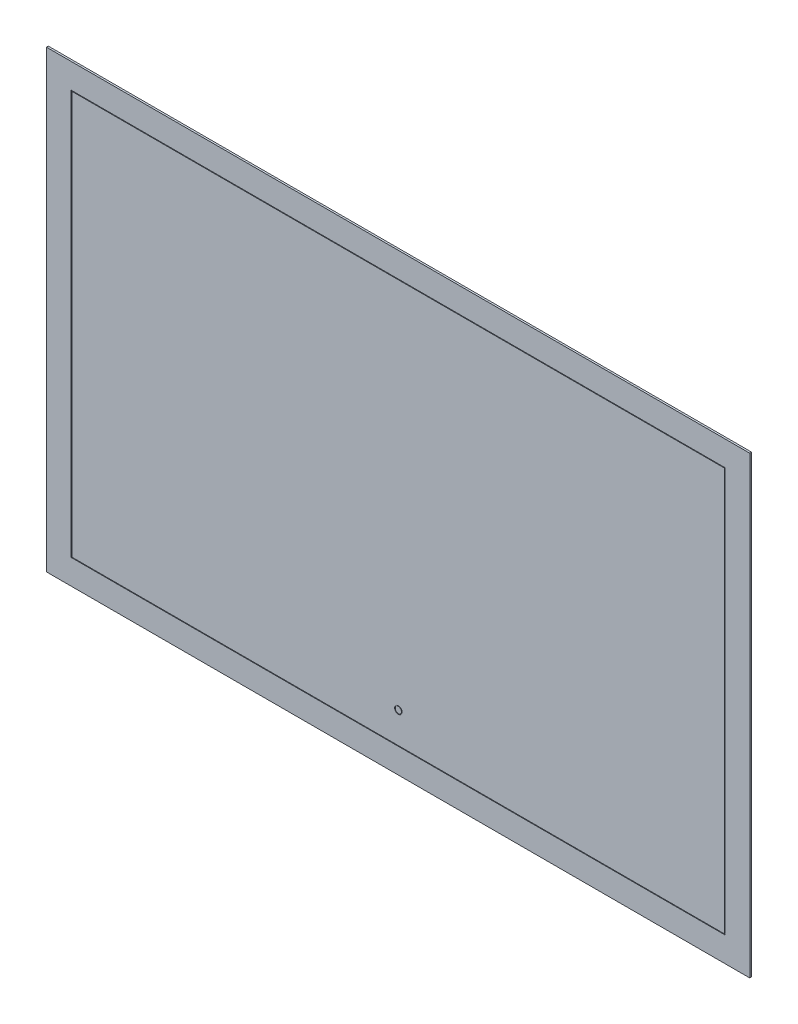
ISO-10303-21;
HEADER;
FILE_DESCRIPTION(('STEP AP214'),'2;1');
FILE_NAME('part.step','',(''),(''),'','','');
FILE_SCHEMA(('AUTOMOTIVE_DESIGN { 1 0 10303 214 1 1 1 1 }'));
ENDSEC;
DATA;
#1=APPLICATION_CONTEXT('core data for automotive mechanical design processes');
#2=APPLICATION_PROTOCOL_DEFINITION('international standard','automotive_design',2000,#1);
#3=PRODUCT_CONTEXT('',#1,'mechanical');
#4=PRODUCT('Part','Part','',(#3));
#5=PRODUCT_RELATED_PRODUCT_CATEGORY('part','',(#4));
#6=PRODUCT_DEFINITION_FORMATION('','',#4);
#7=PRODUCT_DEFINITION_CONTEXT('part definition',#1,'design');
#8=PRODUCT_DEFINITION('design','',#6,#7);
#9=PRODUCT_DEFINITION_SHAPE('','',#8);
#10=(LENGTH_UNIT() NAMED_UNIT(*) SI_UNIT(.MILLI.,.METRE.));
#11=(NAMED_UNIT(*) PLANE_ANGLE_UNIT() SI_UNIT($,.RADIAN.));
#12=(NAMED_UNIT(*) SI_UNIT($,.STERADIAN.) SOLID_ANGLE_UNIT());
#13=UNCERTAINTY_MEASURE_WITH_UNIT(LENGTH_MEASURE(1.E-05),#10,'distance_accuracy_value','');
#14=(GEOMETRIC_REPRESENTATION_CONTEXT(3) GLOBAL_UNCERTAINTY_ASSIGNED_CONTEXT((#13)) GLOBAL_UNIT_ASSIGNED_CONTEXT((#10,
#11,#12)) REPRESENTATION_CONTEXT('',''));
#15=CARTESIAN_POINT('',(0.,0.,0.));
#16=DIRECTION('',(0.,0.,1.));
#17=DIRECTION('',(1.,0.,0.));
#18=AXIS2_PLACEMENT_3D('',#15,#16,#17);
#19=CARTESIAN_POINT('',(0.,0.,0.));
#20=DIRECTION('',(0.,0.,1.));
#21=DIRECTION('',(1.,0.,0.));
#22=AXIS2_PLACEMENT_3D('',#19,#20,#21);
#23=PLANE('',#22);
#24=DIRECTION('',(-1.,0.,0.));
#25=VECTOR('',#24,1.);
#26=CARTESIAN_POINT('',(0.,0.,0.));
#27=LINE('',#26,#25);
#28=CARTESIAN_POINT('',(1130.,0.,0.));
#29=VERTEX_POINT('',#28);
#30=CARTESIAN_POINT('',(0.,0.,0.));
#31=VERTEX_POINT('',#30);
#32=EDGE_CURVE('E356',#29,#31,#27,.T.);
#33=ORIENTED_EDGE('',*,*,#32,.T.);
#34=DIRECTION('',(0.,1.,0.));
#35=VECTOR('',#34,1.);
#36=CARTESIAN_POINT('',(0.,0.,0.));
#37=LINE('',#36,#35);
#38=CARTESIAN_POINT('',(0.,730.,0.));
#39=VERTEX_POINT('',#38);
#40=EDGE_CURVE('E371',#31,#39,#37,.T.);
#41=ORIENTED_EDGE('',*,*,#40,.T.);
#42=DIRECTION('',(1.,0.,0.));
#43=VECTOR('',#42,1.);
#44=CARTESIAN_POINT('',(0.,730.,0.));
#45=LINE('',#44,#43);
#46=CARTESIAN_POINT('',(1130.,730.,0.));
#47=VERTEX_POINT('',#46);
#48=EDGE_CURVE('E391',#39,#47,#45,.T.);
#49=ORIENTED_EDGE('',*,*,#48,.T.);
#50=DIRECTION('',(0.,-1.,0.));
#51=VECTOR('',#50,1.);
#52=CARTESIAN_POINT('',(1130.,3.43712881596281E-13,0.));
#53=LINE('',#52,#51);
#54=EDGE_CURVE('E387',#47,#29,#53,.T.);
#55=ORIENTED_EDGE('',*,*,#54,.T.);
#56=EDGE_LOOP('',(#33,#41,#49,#55));
#57=FACE_BOUND('',#56,.T.);
#58=DIRECTION('',(0.,-1.,0.));
#59=VECTOR('',#58,1.);
#60=CARTESIAN_POINT('',(1095.,695.,0.));
#61=LINE('',#60,#59);
#62=CARTESIAN_POINT('',(1095.,695.,0.));
#63=VERTEX_POINT('',#62);
#64=CARTESIAN_POINT('',(1095.,35.,0.));
#65=VERTEX_POINT('',#64);
#66=EDGE_CURVE('E67',#63,#65,#61,.T.);
#67=ORIENTED_EDGE('',*,*,#66,.F.);
#68=DIRECTION('',(1.,0.,0.));
#69=VECTOR('',#68,1.);
#70=CARTESIAN_POINT('',(35.,695.,0.));
#71=LINE('',#70,#69);
#72=CARTESIAN_POINT('',(35.,695.,0.));
#73=VERTEX_POINT('',#72);
#74=EDGE_CURVE('E239',#73,#63,#71,.T.);
#75=ORIENTED_EDGE('',*,*,#74,.F.);
#76=DIRECTION('',(0.,1.,0.));
#77=VECTOR('',#76,1.);
#78=CARTESIAN_POINT('',(35.,35.,0.));
#79=LINE('',#78,#77);
#80=CARTESIAN_POINT('',(35.,35.,0.));
#81=VERTEX_POINT('',#80);
#82=EDGE_CURVE('E255',#81,#73,#79,.T.);
#83=ORIENTED_EDGE('',*,*,#82,.F.);
#84=DIRECTION('',(-1.,0.,0.));
#85=VECTOR('',#84,1.);
#86=CARTESIAN_POINT('',(1095.,35.,0.));
#87=LINE('',#86,#85);
#88=EDGE_CURVE('E251',#65,#81,#87,.T.);
#89=ORIENTED_EDGE('',*,*,#88,.F.);
#90=EDGE_LOOP('',(#67,#75,#83,#89));
#91=FACE_BOUND('',#90,.T.);
#92=ADVANCED_FACE('F43',(#57,#91),#23,.F.);
#93=CARTESIAN_POINT('',(0.,0.,3.));
#94=DIRECTION('',(0.,-1.,0.));
#95=DIRECTION('',(1.,0.,0.));
#96=AXIS2_PLACEMENT_3D('',#93,#94,#95);
#97=PLANE('',#96);
#98=ORIENTED_EDGE('',*,*,#32,.F.);
#99=DIRECTION('',(0.,0.,-1.));
#100=VECTOR('',#99,1.);
#101=CARTESIAN_POINT('',(1130.,0.,3.));
#102=LINE('',#101,#100);
#103=CARTESIAN_POINT('',(1130.,0.,3.));
#104=VERTEX_POINT('',#103);
#105=EDGE_CURVE('E11',#104,#29,#102,.T.);
#106=ORIENTED_EDGE('',*,*,#105,.F.);
#107=DIRECTION('',(-1.,0.,0.));
#108=VECTOR('',#107,1.);
#109=CARTESIAN_POINT('',(0.,0.,3.));
#110=LINE('',#109,#108);
#111=CARTESIAN_POINT('',(0.,0.,3.));
#112=VERTEX_POINT('',#111);
#113=EDGE_CURVE('E366',#104,#112,#110,.T.);
#114=ORIENTED_EDGE('',*,*,#113,.T.);
#115=DIRECTION('',(0.,0.,-1.));
#116=VECTOR('',#115,1.);
#117=CARTESIAN_POINT('',(0.,0.,3.));
#118=LINE('',#117,#116);
#119=EDGE_CURVE('E383',#112,#31,#118,.T.);
#120=ORIENTED_EDGE('',*,*,#119,.T.);
#121=EDGE_LOOP('',(#98,#106,#114,#120));
#122=FACE_BOUND('',#121,.T.);
#123=ADVANCED_FACE('F45',(#122),#97,.T.);
#124=CARTESIAN_POINT('',(1130.,3.43712881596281E-13,3.));
#125=DIRECTION('',(1.,0.,0.));
#126=DIRECTION('',(0.,1.,0.));
#127=AXIS2_PLACEMENT_3D('',#124,#125,#126);
#128=PLANE('',#127);
#129=ORIENTED_EDGE('',*,*,#54,.F.);
#130=DIRECTION('',(0.,0.,-1.));
#131=VECTOR('',#130,1.);
#132=CARTESIAN_POINT('',(1130.,730.,3.));
#133=LINE('',#132,#131);
#134=CARTESIAN_POINT('',(1130.,730.,3.));
#135=VERTEX_POINT('',#134);
#136=EDGE_CURVE('E52',#135,#47,#133,.T.);
#137=ORIENTED_EDGE('',*,*,#136,.F.);
#138=DIRECTION('',(0.,-1.,0.));
#139=VECTOR('',#138,1.);
#140=CARTESIAN_POINT('',(1130.,3.43712881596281E-13,3.));
#141=LINE('',#140,#139);
#142=EDGE_CURVE('E370',#135,#104,#141,.T.);
#143=ORIENTED_EDGE('',*,*,#142,.T.);
#144=ORIENTED_EDGE('',*,*,#105,.T.);
#145=EDGE_LOOP('',(#129,#137,#143,#144));
#146=FACE_BOUND('',#145,.T.);
#147=ADVANCED_FACE('F410',(#146),#128,.T.);
#148=CARTESIAN_POINT('',(0.,730.,3.));
#149=DIRECTION('',(0.,1.,0.));
#150=DIRECTION('',(0.,0.,1.));
#151=AXIS2_PLACEMENT_3D('',#148,#149,#150);
#152=PLANE('',#151);
#153=ORIENTED_EDGE('',*,*,#48,.F.);
#154=DIRECTION('',(0.,0.,-1.));
#155=VECTOR('',#154,1.);
#156=CARTESIAN_POINT('',(0.,730.,3.));
#157=LINE('',#156,#155);
#158=CARTESIAN_POINT('',(0.,730.,3.));
#159=VERTEX_POINT('',#158);
#160=EDGE_CURVE('E400',#159,#39,#157,.T.);
#161=ORIENTED_EDGE('',*,*,#160,.F.);
#162=DIRECTION('',(1.,0.,0.));
#163=VECTOR('',#162,1.);
#164=CARTESIAN_POINT('',(0.,730.,3.));
#165=LINE('',#164,#163);
#166=EDGE_CURVE('E375',#159,#135,#165,.T.);
#167=ORIENTED_EDGE('',*,*,#166,.T.);
#168=ORIENTED_EDGE('',*,*,#136,.T.);
#169=EDGE_LOOP('',(#153,#161,#167,#168));
#170=FACE_BOUND('',#169,.T.);
#171=ADVANCED_FACE('F406',(#170),#152,.T.);
#172=CARTESIAN_POINT('',(0.,0.,3.));
#173=DIRECTION('',(-1.,0.,0.));
#174=DIRECTION('',(0.,0.,1.));
#175=AXIS2_PLACEMENT_3D('',#172,#173,#174);
#176=PLANE('',#175);
#177=ORIENTED_EDGE('',*,*,#40,.F.);
#178=ORIENTED_EDGE('',*,*,#119,.F.);
#179=DIRECTION('',(0.,1.,0.));
#180=VECTOR('',#179,1.);
#181=CARTESIAN_POINT('',(0.,0.,3.));
#182=LINE('',#181,#180);
#183=EDGE_CURVE('E379',#112,#159,#182,.T.);
#184=ORIENTED_EDGE('',*,*,#183,.T.);
#185=ORIENTED_EDGE('',*,*,#160,.T.);
#186=EDGE_LOOP('',(#177,#178,#184,#185));
#187=FACE_BOUND('',#186,.T.);
#188=ADVANCED_FACE('F415',(#187),#176,.T.);
#189=CARTESIAN_POINT('',(0.,0.,3.));
#190=DIRECTION('',(0.,0.,1.));
#191=DIRECTION('',(1.,0.,0.));
#192=AXIS2_PLACEMENT_3D('',#189,#190,#191);
#193=PLANE('',#192);
#194=DIRECTION('',(0.,-1.,0.));
#195=VECTOR('',#194,1.);
#196=CARTESIAN_POINT('',(40.,690.,3.));
#197=LINE('',#196,#195);
#198=CARTESIAN_POINT('',(40.,690.,3.));
#199=VERTEX_POINT('',#198);
#200=CARTESIAN_POINT('',(40.,40.,3.));
#201=VERTEX_POINT('',#200);
#202=EDGE_CURVE('E312',#199,#201,#197,.T.);
#203=ORIENTED_EDGE('',*,*,#202,.F.);
#204=DIRECTION('',(-1.,0.,0.));
#205=VECTOR('',#204,1.);
#206=CARTESIAN_POINT('',(1090.,690.,3.));
#207=LINE('',#206,#205);
#208=CARTESIAN_POINT('',(1090.,690.,3.));
#209=VERTEX_POINT('',#208);
#210=EDGE_CURVE('E327',#209,#199,#207,.T.);
#211=ORIENTED_EDGE('',*,*,#210,.F.);
#212=DIRECTION('',(0.,1.,0.));
#213=VECTOR('',#212,1.);
#214=CARTESIAN_POINT('',(1090.,40.,3.));
#215=LINE('',#214,#213);
#216=CARTESIAN_POINT('',(1090.,40.,3.));
#217=VERTEX_POINT('',#216);
#218=EDGE_CURVE('E346',#217,#209,#215,.T.);
#219=ORIENTED_EDGE('',*,*,#218,.F.);
#220=DIRECTION('',(1.,0.,0.));
#221=VECTOR('',#220,1.);
#222=CARTESIAN_POINT('',(40.,40.,3.));
#223=LINE('',#222,#221);
#224=EDGE_CURVE('E342',#201,#217,#223,.T.);
#225=ORIENTED_EDGE('',*,*,#224,.F.);
#226=EDGE_LOOP('',(#203,#211,#219,#225));
#227=FACE_BOUND('',#226,.T.);
#228=ORIENTED_EDGE('',*,*,#113,.F.);
#229=ORIENTED_EDGE('',*,*,#142,.F.);
#230=ORIENTED_EDGE('',*,*,#166,.F.);
#231=ORIENTED_EDGE('',*,*,#183,.F.);
#232=EDGE_LOOP('',(#228,#229,#230,#231));
#233=FACE_BOUND('',#232,.T.);
#234=ADVANCED_FACE('F419',(#227,#233),#193,.T.);
#235=CARTESIAN_POINT('',(40.,690.,2.));
#236=DIRECTION('',(-1.,0.,0.));
#237=DIRECTION('',(0.,0.,1.));
#238=AXIS2_PLACEMENT_3D('',#235,#236,#237);
#239=PLANE('',#238);
#240=ORIENTED_EDGE('',*,*,#202,.T.);
#241=DIRECTION('',(0.,0.,1.));
#242=VECTOR('',#241,1.);
#243=CARTESIAN_POINT('',(40.,40.,2.));
#244=LINE('',#243,#242);
#245=CARTESIAN_POINT('',(40.,40.,2.));
#246=VERTEX_POINT('',#245);
#247=EDGE_CURVE('E339',#246,#201,#244,.T.);
#248=ORIENTED_EDGE('',*,*,#247,.F.);
#249=DIRECTION('',(0.,-1.,0.));
#250=VECTOR('',#249,1.);
#251=CARTESIAN_POINT('',(40.,690.,2.));
#252=LINE('',#251,#250);
#253=CARTESIAN_POINT('',(40.,690.,2.));
#254=VERTEX_POINT('',#253);
#255=EDGE_CURVE('E322',#254,#246,#252,.T.);
#256=ORIENTED_EDGE('',*,*,#255,.F.);
#257=DIRECTION('',(0.,0.,1.));
#258=VECTOR('',#257,1.);
#259=CARTESIAN_POINT('',(40.,690.,2.));
#260=LINE('',#259,#258);
#261=EDGE_CURVE('E353',#254,#199,#260,.T.);
#262=ORIENTED_EDGE('',*,*,#261,.T.);
#263=EDGE_LOOP('',(#240,#248,#256,#262));
#264=FACE_BOUND('',#263,.T.);
#265=ADVANCED_FACE('F450',(#264),#239,.F.);
#266=CARTESIAN_POINT('',(1090.,690.,2.));
#267=DIRECTION('',(0.,1.,0.));
#268=DIRECTION('',(0.,0.,1.));
#269=AXIS2_PLACEMENT_3D('',#266,#267,#268);
#270=PLANE('',#269);
#271=ORIENTED_EDGE('',*,*,#210,.T.);
#272=ORIENTED_EDGE('',*,*,#261,.F.);
#273=DIRECTION('',(-1.,0.,0.));
#274=VECTOR('',#273,1.);
#275=CARTESIAN_POINT('',(1090.,690.,2.));
#276=LINE('',#275,#274);
#277=CARTESIAN_POINT('',(1090.,690.,2.));
#278=VERTEX_POINT('',#277);
#279=EDGE_CURVE('E335',#278,#254,#276,.T.);
#280=ORIENTED_EDGE('',*,*,#279,.F.);
#281=DIRECTION('',(0.,0.,1.));
#282=VECTOR('',#281,1.);
#283=CARTESIAN_POINT('',(1090.,690.,2.));
#284=LINE('',#283,#282);
#285=EDGE_CURVE('E357',#278,#209,#284,.T.);
#286=ORIENTED_EDGE('',*,*,#285,.T.);
#287=EDGE_LOOP('',(#271,#272,#280,#286));
#288=FACE_BOUND('',#287,.T.);
#289=ADVANCED_FACE('F459',(#288),#270,.F.);
#290=CARTESIAN_POINT('',(1090.,40.,2.));
#291=DIRECTION('',(1.,0.,0.));
#292=DIRECTION('',(0.,1.,0.));
#293=AXIS2_PLACEMENT_3D('',#290,#291,#292);
#294=PLANE('',#293);
#295=ORIENTED_EDGE('',*,*,#218,.T.);
#296=ORIENTED_EDGE('',*,*,#285,.F.);
#297=DIRECTION('',(0.,1.,0.));
#298=VECTOR('',#297,1.);
#299=CARTESIAN_POINT('',(1090.,40.,2.));
#300=LINE('',#299,#298);
#301=CARTESIAN_POINT('',(1090.,40.,2.));
#302=VERTEX_POINT('',#301);
#303=EDGE_CURVE('E331',#302,#278,#300,.T.);
#304=ORIENTED_EDGE('',*,*,#303,.F.);
#305=DIRECTION('',(0.,0.,1.));
#306=VECTOR('',#305,1.);
#307=CARTESIAN_POINT('',(1090.,40.,2.));
#308=LINE('',#307,#306);
#309=EDGE_CURVE('E360',#302,#217,#308,.T.);
#310=ORIENTED_EDGE('',*,*,#309,.T.);
#311=EDGE_LOOP('',(#295,#296,#304,#310));
#312=FACE_BOUND('',#311,.T.);
#313=ADVANCED_FACE('F466',(#312),#294,.F.);
#314=CARTESIAN_POINT('',(40.,40.,2.));
#315=DIRECTION('',(0.,-1.,0.));
#316=DIRECTION('',(1.,0.,0.));
#317=AXIS2_PLACEMENT_3D('',#314,#315,#316);
#318=PLANE('',#317);
#319=ORIENTED_EDGE('',*,*,#224,.T.);
#320=ORIENTED_EDGE('',*,*,#309,.F.);
#321=DIRECTION('',(1.,0.,0.));
#322=VECTOR('',#321,1.);
#323=CARTESIAN_POINT('',(40.,40.,2.));
#324=LINE('',#323,#322);
#325=EDGE_CURVE('E326',#246,#302,#324,.T.);
#326=ORIENTED_EDGE('',*,*,#325,.F.);
#327=ORIENTED_EDGE('',*,*,#247,.T.);
#328=EDGE_LOOP('',(#319,#320,#326,#327));
#329=FACE_BOUND('',#328,.T.);
#330=ADVANCED_FACE('F474',(#329),#318,.F.);
#331=CARTESIAN_POINT('',(0.,0.,2.));
#332=DIRECTION('',(0.,0.,1.));
#333=DIRECTION('',(1.,0.,0.));
#334=AXIS2_PLACEMENT_3D('',#331,#332,#333);
#335=PLANE('',#334);
#336=DIRECTION('',(0.,1.,0.));
#337=VECTOR('',#336,1.);
#338=CARTESIAN_POINT('',(1089.,41.0000000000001,2.));
#339=LINE('',#338,#337);
#340=CARTESIAN_POINT('',(1089.,41.0000000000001,2.));
#341=VERTEX_POINT('',#340);
#342=CARTESIAN_POINT('',(1089.,689.,2.));
#343=VERTEX_POINT('',#342);
#344=EDGE_CURVE('E290',#341,#343,#339,.T.);
#345=ORIENTED_EDGE('',*,*,#344,.F.);
#346=DIRECTION('',(1.,0.,0.));
#347=VECTOR('',#346,1.);
#348=CARTESIAN_POINT('',(41.,41.,2.));
#349=LINE('',#348,#347);
#350=CARTESIAN_POINT('',(41.,41.,2.));
#351=VERTEX_POINT('',#350);
#352=EDGE_CURVE('E286',#351,#341,#349,.T.);
#353=ORIENTED_EDGE('',*,*,#352,.F.);
#354=DIRECTION('',(0.,-1.,0.));
#355=VECTOR('',#354,1.);
#356=CARTESIAN_POINT('',(41.,689.,2.));
#357=LINE('',#356,#355);
#358=CARTESIAN_POINT('',(41.,689.,2.));
#359=VERTEX_POINT('',#358);
#360=EDGE_CURVE('E281',#359,#351,#357,.T.);
#361=ORIENTED_EDGE('',*,*,#360,.F.);
#362=DIRECTION('',(-1.,0.,0.));
#363=VECTOR('',#362,1.);
#364=CARTESIAN_POINT('',(1089.,689.,2.));
#365=LINE('',#364,#363);
#366=EDGE_CURVE('E277',#343,#359,#365,.T.);
#367=ORIENTED_EDGE('',*,*,#366,.F.);
#368=EDGE_LOOP('',(#345,#353,#361,#367));
#369=FACE_BOUND('',#368,.T.);
#370=ORIENTED_EDGE('',*,*,#255,.T.);
#371=ORIENTED_EDGE('',*,*,#325,.T.);
#372=ORIENTED_EDGE('',*,*,#303,.T.);
#373=ORIENTED_EDGE('',*,*,#279,.T.);
#374=EDGE_LOOP('',(#370,#371,#372,#373));
#375=FACE_BOUND('',#374,.T.);
#376=ADVANCED_FACE('F482',(#369,#375),#335,.T.);
#377=CARTESIAN_POINT('',(1089.,689.,2.));
#378=DIRECTION('',(0.,1.,0.));
#379=DIRECTION('',(-1.,0.,0.));
#380=AXIS2_PLACEMENT_3D('',#377,#378,#379);
#381=PLANE('',#380);
#382=DIRECTION('',(-1.,0.,0.));
#383=VECTOR('',#382,1.);
#384=CARTESIAN_POINT('',(1089.,689.,3.));
#385=LINE('',#384,#383);
#386=CARTESIAN_POINT('',(1089.,689.,3.));
#387=VERTEX_POINT('',#386);
#388=CARTESIAN_POINT('',(41.,689.,3.));
#389=VERTEX_POINT('',#388);
#390=EDGE_CURVE('E276',#387,#389,#385,.T.);
#391=ORIENTED_EDGE('',*,*,#390,.F.);
#392=DIRECTION('',(0.,0.,1.));
#393=VECTOR('',#392,1.);
#394=CARTESIAN_POINT('',(1089.,689.,2.));
#395=LINE('',#394,#393);
#396=EDGE_CURVE('E309',#343,#387,#395,.T.);
#397=ORIENTED_EDGE('',*,*,#396,.F.);
#398=ORIENTED_EDGE('',*,*,#366,.T.);
#399=DIRECTION('',(0.,0.,1.));
#400=VECTOR('',#399,1.);
#401=CARTESIAN_POINT('',(41.,689.,2.));
#402=LINE('',#401,#400);
#403=EDGE_CURVE('E294',#359,#389,#402,.T.);
#404=ORIENTED_EDGE('',*,*,#403,.T.);
#405=EDGE_LOOP('',(#391,#397,#398,#404));
#406=FACE_BOUND('',#405,.T.);
#407=ADVANCED_FACE('F490',(#406),#381,.T.);
#408=CARTESIAN_POINT('',(1089.,41.0000000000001,2.));
#409=DIRECTION('',(1.,0.,0.));
#410=DIRECTION('',(0.,0.,-1.));
#411=AXIS2_PLACEMENT_3D('',#408,#409,#410);
#412=PLANE('',#411);
#413=DIRECTION('',(0.,1.,0.));
#414=VECTOR('',#413,1.);
#415=CARTESIAN_POINT('',(1089.,41.0000000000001,3.));
#416=LINE('',#415,#414);
#417=CARTESIAN_POINT('',(1089.,41.0000000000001,3.));
#418=VERTEX_POINT('',#417);
#419=EDGE_CURVE('E282',#418,#387,#416,.T.);
#420=ORIENTED_EDGE('',*,*,#419,.F.);
#421=DIRECTION('',(0.,0.,1.));
#422=VECTOR('',#421,1.);
#423=CARTESIAN_POINT('',(1089.,41.0000000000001,2.));
#424=LINE('',#423,#422);
#425=EDGE_CURVE('E313',#341,#418,#424,.T.);
#426=ORIENTED_EDGE('',*,*,#425,.F.);
#427=ORIENTED_EDGE('',*,*,#344,.T.);
#428=ORIENTED_EDGE('',*,*,#396,.T.);
#429=EDGE_LOOP('',(#420,#426,#427,#428));
#430=FACE_BOUND('',#429,.T.);
#431=ADVANCED_FACE('F498',(#430),#412,.T.);
#432=CARTESIAN_POINT('',(41.,41.,2.));
#433=DIRECTION('',(0.,-1.,0.));
#434=DIRECTION('',(1.,0.,0.));
#435=AXIS2_PLACEMENT_3D('',#432,#433,#434);
#436=PLANE('',#435);
#437=DIRECTION('',(1.,0.,0.));
#438=VECTOR('',#437,1.);
#439=CARTESIAN_POINT('',(41.,41.,3.));
#440=LINE('',#439,#438);
#441=CARTESIAN_POINT('',(41.,41.,3.));
#442=VERTEX_POINT('',#441);
#443=EDGE_CURVE('E302',#442,#418,#440,.T.);
#444=ORIENTED_EDGE('',*,*,#443,.F.);
#445=DIRECTION('',(0.,0.,1.));
#446=VECTOR('',#445,1.);
#447=CARTESIAN_POINT('',(41.,41.,2.));
#448=LINE('',#447,#446);
#449=EDGE_CURVE('E316',#351,#442,#448,.T.);
#450=ORIENTED_EDGE('',*,*,#449,.F.);
#451=ORIENTED_EDGE('',*,*,#352,.T.);
#452=ORIENTED_EDGE('',*,*,#425,.T.);
#453=EDGE_LOOP('',(#444,#450,#451,#452));
#454=FACE_BOUND('',#453,.T.);
#455=ADVANCED_FACE('F506',(#454),#436,.T.);
#456=CARTESIAN_POINT('',(41.,689.,2.));
#457=DIRECTION('',(-1.,0.,0.));
#458=DIRECTION('',(0.,0.,1.));
#459=AXIS2_PLACEMENT_3D('',#456,#457,#458);
#460=PLANE('',#459);
#461=DIRECTION('',(0.,-1.,0.));
#462=VECTOR('',#461,1.);
#463=CARTESIAN_POINT('',(41.,689.,3.));
#464=LINE('',#463,#462);
#465=EDGE_CURVE('E298',#389,#442,#464,.T.);
#466=ORIENTED_EDGE('',*,*,#465,.F.);
#467=ORIENTED_EDGE('',*,*,#403,.F.);
#468=ORIENTED_EDGE('',*,*,#360,.T.);
#469=ORIENTED_EDGE('',*,*,#449,.T.);
#470=EDGE_LOOP('',(#466,#467,#468,#469));
#471=FACE_BOUND('',#470,.T.);
#472=ADVANCED_FACE('F514',(#471),#460,.T.);
#473=CARTESIAN_POINT('',(565.5,90.4999999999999,3.));
#474=DIRECTION('',(0.,0.,1.));
#475=DIRECTION('',(1.,0.,0.));
#476=AXIS2_PLACEMENT_3D('',#473,#474,#475);
#477=CIRCLE('',#476,5.99999999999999);
#478=CARTESIAN_POINT('',(571.5,90.4999999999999,3.));
#479=VERTEX_POINT('',#478);
#480=EDGE_CURVE('E210',#479,#479,#477,.T.);
#481=ORIENTED_EDGE('',*,*,#480,.F.);
#482=EDGE_LOOP('',(#481));
#483=FACE_BOUND('',#482,.T.);
#484=ORIENTED_EDGE('',*,*,#419,.T.);
#485=ORIENTED_EDGE('',*,*,#390,.T.);
#486=ORIENTED_EDGE('',*,*,#465,.T.);
#487=ORIENTED_EDGE('',*,*,#443,.T.);
#488=EDGE_LOOP('',(#484,#485,#486,#487));
#489=FACE_BOUND('',#488,.T.);
#490=ADVANCED_FACE('F453',(#483,#489),#193,.T.);
#491=CARTESIAN_POINT('',(1095.,695.,-30.));
#492=DIRECTION('',(-1.,0.,0.));
#493=DIRECTION('',(0.,-1.,0.));
#494=AXIS2_PLACEMENT_3D('',#491,#492,#493);
#495=PLANE('',#494);
#496=ORIENTED_EDGE('',*,*,#66,.T.);
#497=DIRECTION('',(0.,0.,1.));
#498=VECTOR('',#497,1.);
#499=CARTESIAN_POINT('',(1095.,35.,-30.));
#500=LINE('',#499,#498);
#501=CARTESIAN_POINT('',(1095.,35.,-30.));
#502=VERTEX_POINT('',#501);
#503=EDGE_CURVE('E272',#502,#65,#500,.T.);
#504=ORIENTED_EDGE('',*,*,#503,.F.);
#505=DIRECTION('',(0.,-1.,0.));
#506=VECTOR('',#505,1.);
#507=CARTESIAN_POINT('',(1095.,695.,-30.));
#508=LINE('',#507,#506);
#509=CARTESIAN_POINT('',(1095.,695.,-30.));
#510=VERTEX_POINT('',#509);
#511=EDGE_CURVE('E234',#510,#502,#508,.T.);
#512=ORIENTED_EDGE('',*,*,#511,.F.);
#513=DIRECTION('',(0.,0.,1.));
#514=VECTOR('',#513,1.);
#515=CARTESIAN_POINT('',(1095.,695.,-30.));
#516=LINE('',#515,#514);
#517=EDGE_CURVE('E248',#510,#63,#516,.T.);
#518=ORIENTED_EDGE('',*,*,#517,.T.);
#519=EDGE_LOOP('',(#496,#504,#512,#518));
#520=FACE_BOUND('',#519,.T.);
#521=ADVANCED_FACE('F529',(#520),#495,.F.);
#522=CARTESIAN_POINT('',(1095.,35.,-30.));
#523=DIRECTION('',(0.,1.,0.));
#524=DIRECTION('',(-1.,0.,0.));
#525=AXIS2_PLACEMENT_3D('',#522,#523,#524);
#526=PLANE('',#525);
#527=ORIENTED_EDGE('',*,*,#88,.T.);
#528=DIRECTION('',(0.,0.,1.));
#529=VECTOR('',#528,1.);
#530=CARTESIAN_POINT('',(35.,35.,-30.));
#531=LINE('',#530,#529);
#532=CARTESIAN_POINT('',(35.,35.,-30.));
#533=VERTEX_POINT('',#532);
#534=EDGE_CURVE('E268',#533,#81,#531,.T.);
#535=ORIENTED_EDGE('',*,*,#534,.F.);
#536=DIRECTION('',(-1.,0.,0.));
#537=VECTOR('',#536,1.);
#538=CARTESIAN_POINT('',(1095.,35.,-30.));
#539=LINE('',#538,#537);
#540=EDGE_CURVE('E238',#502,#533,#539,.T.);
#541=ORIENTED_EDGE('',*,*,#540,.F.);
#542=ORIENTED_EDGE('',*,*,#503,.T.);
#543=EDGE_LOOP('',(#527,#535,#541,#542));
#544=FACE_BOUND('',#543,.T.);
#545=ADVANCED_FACE('F536',(#544),#526,.F.);
#546=CARTESIAN_POINT('',(35.,35.,-30.));
#547=DIRECTION('',(1.,0.,0.));
#548=DIRECTION('',(0.,0.,-1.));
#549=AXIS2_PLACEMENT_3D('',#546,#547,#548);
#550=PLANE('',#549);
#551=ORIENTED_EDGE('',*,*,#82,.T.);
#552=DIRECTION('',(0.,0.,1.));
#553=VECTOR('',#552,1.);
#554=CARTESIAN_POINT('',(35.,695.,-30.));
#555=LINE('',#554,#553);
#556=CARTESIAN_POINT('',(35.,695.,-30.));
#557=VERTEX_POINT('',#556);
#558=EDGE_CURVE('E264',#557,#73,#555,.T.);
#559=ORIENTED_EDGE('',*,*,#558,.F.);
#560=DIRECTION('',(0.,1.,0.));
#561=VECTOR('',#560,1.);
#562=CARTESIAN_POINT('',(35.,35.,-30.));
#563=LINE('',#562,#561);
#564=EDGE_CURVE('E242',#533,#557,#563,.T.);
#565=ORIENTED_EDGE('',*,*,#564,.F.);
#566=ORIENTED_EDGE('',*,*,#534,.T.);
#567=EDGE_LOOP('',(#551,#559,#565,#566));
#568=FACE_BOUND('',#567,.T.);
#569=ADVANCED_FACE('F544',(#568),#550,.F.);
#570=CARTESIAN_POINT('',(35.,695.,-30.));
#571=DIRECTION('',(0.,-1.,0.));
#572=DIRECTION('',(0.,0.,-1.));
#573=AXIS2_PLACEMENT_3D('',#570,#571,#572);
#574=PLANE('',#573);
#575=ORIENTED_EDGE('',*,*,#74,.T.);
#576=ORIENTED_EDGE('',*,*,#517,.F.);
#577=DIRECTION('',(1.,0.,0.));
#578=VECTOR('',#577,1.);
#579=CARTESIAN_POINT('',(35.,695.,-30.));
#580=LINE('',#579,#578);
#581=EDGE_CURVE('E245',#557,#510,#580,.T.);
#582=ORIENTED_EDGE('',*,*,#581,.F.);
#583=ORIENTED_EDGE('',*,*,#558,.T.);
#584=EDGE_LOOP('',(#575,#576,#582,#583));
#585=FACE_BOUND('',#584,.T.);
#586=ADVANCED_FACE('F552',(#585),#574,.F.);
#587=CARTESIAN_POINT('',(0.,0.,-30.));
#588=DIRECTION('',(0.,0.,-1.));
#589=DIRECTION('',(-1.,0.,0.));
#590=AXIS2_PLACEMENT_3D('',#587,#588,#589);
#591=PLANE('',#590);
#592=DIRECTION('',(1.,0.,0.));
#593=VECTOR('',#592,1.);
#594=CARTESIAN_POINT('',(36.,694.,-30.));
#595=LINE('',#594,#593);
#596=CARTESIAN_POINT('',(36.,694.,-30.));
#597=VERTEX_POINT('',#596);
#598=CARTESIAN_POINT('',(1094.,694.,-30.));
#599=VERTEX_POINT('',#598);
#600=EDGE_CURVE('E59',#597,#599,#595,.T.);
#601=ORIENTED_EDGE('',*,*,#600,.F.);
#602=DIRECTION('',(0.,1.,0.));
#603=VECTOR('',#602,1.);
#604=CARTESIAN_POINT('',(36.,36.,-30.));
#605=LINE('',#604,#603);
#606=CARTESIAN_POINT('',(36.,36.,-30.));
#607=VERTEX_POINT('',#606);
#608=EDGE_CURVE('E203',#607,#597,#605,.T.);
#609=ORIENTED_EDGE('',*,*,#608,.F.);
#610=DIRECTION('',(-1.,0.,0.));
#611=VECTOR('',#610,1.);
#612=CARTESIAN_POINT('',(1094.,36.,-30.));
#613=LINE('',#612,#611);
#614=CARTESIAN_POINT('',(1094.,36.,-30.));
#615=VERTEX_POINT('',#614);
#616=EDGE_CURVE('E207',#615,#607,#613,.T.);
#617=ORIENTED_EDGE('',*,*,#616,.F.);
#618=DIRECTION('',(0.,-1.,0.));
#619=VECTOR('',#618,1.);
#620=CARTESIAN_POINT('',(1094.,694.,-30.));
#621=LINE('',#620,#619);
#622=EDGE_CURVE('E219',#599,#615,#621,.T.);
#623=ORIENTED_EDGE('',*,*,#622,.F.);
#624=EDGE_LOOP('',(#601,#609,#617,#623));
#625=FACE_BOUND('',#624,.T.);
#626=ORIENTED_EDGE('',*,*,#511,.T.);
#627=ORIENTED_EDGE('',*,*,#540,.T.);
#628=ORIENTED_EDGE('',*,*,#564,.T.);
#629=ORIENTED_EDGE('',*,*,#581,.T.);
#630=EDGE_LOOP('',(#626,#627,#628,#629));
#631=FACE_BOUND('',#630,.T.);
#632=ADVANCED_FACE('F560',(#625,#631),#591,.T.);
#633=CARTESIAN_POINT('',(36.,694.,0.));
#634=DIRECTION('',(0.,1.,0.));
#635=DIRECTION('',(0.,0.,1.));
#636=AXIS2_PLACEMENT_3D('',#633,#634,#635);
#637=PLANE('',#636);
#638=ORIENTED_EDGE('',*,*,#600,.T.);
#639=DIRECTION('',(0.,0.,-1.));
#640=VECTOR('',#639,1.);
#641=CARTESIAN_POINT('',(1094.,694.,0.));
#642=LINE('',#641,#640);
#643=CARTESIAN_POINT('',(1094.,694.,0.));
#644=VERTEX_POINT('',#643);
#645=EDGE_CURVE('E178',#644,#599,#642,.T.);
#646=ORIENTED_EDGE('',*,*,#645,.F.);
#647=DIRECTION('',(1.,0.,0.));
#648=VECTOR('',#647,1.);
#649=CARTESIAN_POINT('',(36.,694.,0.));
#650=LINE('',#649,#648);
#651=CARTESIAN_POINT('',(36.,694.,0.));
#652=VERTEX_POINT('',#651);
#653=EDGE_CURVE('E182',#652,#644,#650,.T.);
#654=ORIENTED_EDGE('',*,*,#653,.F.);
#655=DIRECTION('',(0.,0.,-1.));
#656=VECTOR('',#655,1.);
#657=CARTESIAN_POINT('',(36.,694.,0.));
#658=LINE('',#657,#656);
#659=EDGE_CURVE('E226',#652,#597,#658,.T.);
#660=ORIENTED_EDGE('',*,*,#659,.T.);
#661=EDGE_LOOP('',(#638,#646,#654,#660));
#662=FACE_BOUND('',#661,.T.);
#663=ADVANCED_FACE('F180',(#662),#637,.F.);
#664=CARTESIAN_POINT('',(36.,36.,0.));
#665=DIRECTION('',(-1.,0.,0.));
#666=DIRECTION('',(0.,0.,1.));
#667=AXIS2_PLACEMENT_3D('',#664,#665,#666);
#668=PLANE('',#667);
#669=ORIENTED_EDGE('',*,*,#608,.T.);
#670=ORIENTED_EDGE('',*,*,#659,.F.);
#671=DIRECTION('',(0.,1.,0.));
#672=VECTOR('',#671,1.);
#673=CARTESIAN_POINT('',(36.,36.,0.));
#674=LINE('',#673,#672);
#675=CARTESIAN_POINT('',(36.,36.,0.));
#676=VERTEX_POINT('',#675);
#677=EDGE_CURVE('E189',#676,#652,#674,.T.);
#678=ORIENTED_EDGE('',*,*,#677,.F.);
#679=DIRECTION('',(0.,0.,-1.));
#680=VECTOR('',#679,1.);
#681=CARTESIAN_POINT('',(36.,36.,0.));
#682=LINE('',#681,#680);
#683=EDGE_CURVE('E229',#676,#607,#682,.T.);
#684=ORIENTED_EDGE('',*,*,#683,.T.);
#685=EDGE_LOOP('',(#669,#670,#678,#684));
#686=FACE_BOUND('',#685,.T.);
#687=ADVANCED_FACE('F575',(#686),#668,.F.);
#688=CARTESIAN_POINT('',(1094.,36.,0.));
#689=DIRECTION('',(0.,-1.,0.));
#690=DIRECTION('',(1.,0.,0.));
#691=AXIS2_PLACEMENT_3D('',#688,#689,#690);
#692=PLANE('',#691);
#693=ORIENTED_EDGE('',*,*,#616,.T.);
#694=ORIENTED_EDGE('',*,*,#683,.F.);
#695=DIRECTION('',(-1.,0.,0.));
#696=VECTOR('',#695,1.);
#697=CARTESIAN_POINT('',(1094.,36.,0.));
#698=LINE('',#697,#696);
#699=CARTESIAN_POINT('',(1094.,36.,0.));
#700=VERTEX_POINT('',#699);
#701=EDGE_CURVE('E198',#700,#676,#698,.T.);
#702=ORIENTED_EDGE('',*,*,#701,.F.);
#703=DIRECTION('',(0.,0.,-1.));
#704=VECTOR('',#703,1.);
#705=CARTESIAN_POINT('',(1094.,36.,0.));
#706=LINE('',#705,#704);
#707=EDGE_CURVE('E188',#700,#615,#706,.T.);
#708=ORIENTED_EDGE('',*,*,#707,.T.);
#709=EDGE_LOOP('',(#693,#694,#702,#708));
#710=FACE_BOUND('',#709,.T.);
#711=ADVANCED_FACE('F582',(#710),#692,.F.);
#712=CARTESIAN_POINT('',(1094.,694.,0.));
#713=DIRECTION('',(1.,0.,0.));
#714=DIRECTION('',(0.,1.,0.));
#715=AXIS2_PLACEMENT_3D('',#712,#713,#714);
#716=PLANE('',#715);
#717=ORIENTED_EDGE('',*,*,#622,.T.);
#718=ORIENTED_EDGE('',*,*,#707,.F.);
#719=DIRECTION('',(0.,-1.,0.));
#720=VECTOR('',#719,1.);
#721=CARTESIAN_POINT('',(1094.,694.,0.));
#722=LINE('',#721,#720);
#723=EDGE_CURVE('E192',#644,#700,#722,.T.);
#724=ORIENTED_EDGE('',*,*,#723,.F.);
#725=ORIENTED_EDGE('',*,*,#645,.T.);
#726=EDGE_LOOP('',(#717,#718,#724,#725));
#727=FACE_BOUND('',#726,.T.);
#728=ADVANCED_FACE('F193',(#727),#716,.F.);
#729=CARTESIAN_POINT('',(0.,0.,0.));
#730=DIRECTION('',(0.,0.,-1.));
#731=DIRECTION('',(-1.,0.,0.));
#732=AXIS2_PLACEMENT_3D('',#729,#730,#731);
#733=PLANE('',#732);
#734=ORIENTED_EDGE('',*,*,#653,.T.);
#735=ORIENTED_EDGE('',*,*,#723,.T.);
#736=ORIENTED_EDGE('',*,*,#701,.T.);
#737=ORIENTED_EDGE('',*,*,#677,.T.);
#738=EDGE_LOOP('',(#734,#735,#736,#737));
#739=FACE_BOUND('',#738,.T.);
#740=ADVANCED_FACE('F200',(#739),#733,.T.);
#741=CARTESIAN_POINT('',(565.5,90.4999999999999,2.));
#742=DIRECTION('',(0.,0.,1.));
#743=DIRECTION('',(1.,0.,0.));
#744=AXIS2_PLACEMENT_3D('',#741,#742,#743);
#745=CYLINDRICAL_SURFACE('',#744,5.99999999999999);
#746=CARTESIAN_POINT('',(565.5,90.4999999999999,2.));
#747=DIRECTION('',(0.,0.,1.));
#748=DIRECTION('',(1.,0.,0.));
#749=AXIS2_PLACEMENT_3D('',#746,#747,#748);
#750=CIRCLE('',#749,5.99999999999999);
#751=CARTESIAN_POINT('',(571.5,90.4999999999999,2.));
#752=VERTEX_POINT('',#751);
#753=EDGE_CURVE('E220',#752,#752,#750,.T.);
#754=ORIENTED_EDGE('',*,*,#753,.F.);
#755=EDGE_LOOP('',(#754));
#756=FACE_BOUND('',#755,.T.);
#757=ORIENTED_EDGE('',*,*,#480,.T.);
#758=EDGE_LOOP('',(#757));
#759=FACE_BOUND('',#758,.T.);
#760=ADVANCED_FACE('F603',(#756,#759),#745,.F.);
#761=CARTESIAN_POINT('',(565.5,90.4999999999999,2.));
#762=DIRECTION('',(0.,0.,1.));
#763=DIRECTION('',(1.,0.,0.));
#764=AXIS2_PLACEMENT_3D('',#761,#762,#763);
#765=PLANE('',#764);
#766=CARTESIAN_POINT('',(565.5,90.4999999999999,2.));
#767=DIRECTION('',(0.,0.,1.));
#768=DIRECTION('',(1.,0.,0.));
#769=AXIS2_PLACEMENT_3D('',#766,#767,#768);
#770=CIRCLE('',#769,5.00000000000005);
#771=CARTESIAN_POINT('',(570.5,90.4999999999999,2.));
#772=VERTEX_POINT('',#771);
#773=EDGE_CURVE('E711',#772,#772,#770,.T.);
#774=ORIENTED_EDGE('',*,*,#773,.F.);
#775=EDGE_LOOP('',(#774));
#776=FACE_BOUND('',#775,.T.);
#777=ORIENTED_EDGE('',*,*,#753,.T.);
#778=EDGE_LOOP('',(#777));
#779=FACE_BOUND('',#778,.T.);
#780=ADVANCED_FACE('F610',(#776,#779),#765,.T.);
#781=CARTESIAN_POINT('',(565.5,90.4999999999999,2.));
#782=DIRECTION('',(0.,0.,1.));
#783=DIRECTION('',(1.,0.,0.));
#784=AXIS2_PLACEMENT_3D('',#781,#782,#783);
#785=CYLINDRICAL_SURFACE('',#784,5.00000000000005);
#786=ORIENTED_EDGE('',*,*,#773,.T.);
#787=EDGE_LOOP('',(#786));
#788=FACE_BOUND('',#787,.T.);
#789=CARTESIAN_POINT('',(565.5,90.4999999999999,3.));
#790=DIRECTION('',(0.,0.,1.));
#791=DIRECTION('',(1.,0.,0.));
#792=AXIS2_PLACEMENT_3D('',#789,#790,#791);
#793=CIRCLE('',#792,5.00000000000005);
#794=CARTESIAN_POINT('',(570.5,90.4999999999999,3.));
#795=VERTEX_POINT('',#794);
#796=EDGE_CURVE('E708',#795,#795,#793,.T.);
#797=ORIENTED_EDGE('',*,*,#796,.F.);
#798=EDGE_LOOP('',(#797));
#799=FACE_BOUND('',#798,.T.);
#800=ADVANCED_FACE('F618',(#788,#799),#785,.T.);
#801=ORIENTED_EDGE('',*,*,#796,.T.);
#802=EDGE_LOOP('',(#801));
#803=FACE_BOUND('',#802,.T.);
#804=ADVANCED_FACE('F452',(#803),#193,.T.);
#805=CLOSED_SHELL('',(#92,#123,#147,#171,#188,#234,#265,#289,#313,#330,#376,#407,#431,#455,#472,
#490,#521,#545,#569,#586,#632,#663,#687,#711,#728,#740,#760,#780,#800,#804));
#806=MANIFOLD_SOLID_BREP('B2',#805);
#807=ADVANCED_BREP_SHAPE_REPRESENTATION('',(#18,#806),#14);
#808=SHAPE_DEFINITION_REPRESENTATION(#9,#807);
ENDSEC;
END-ISO-10303-21;
